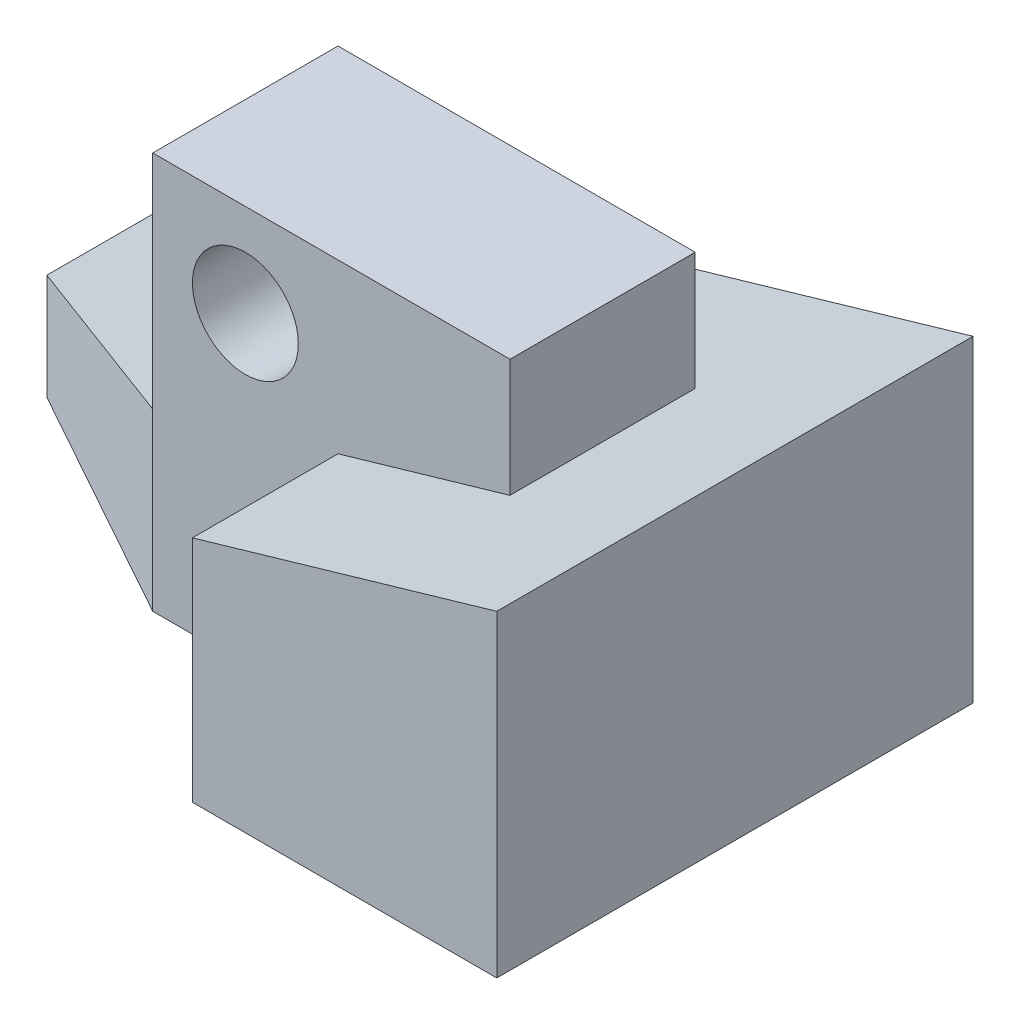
from build123d import *

# Parameters (mm, degrees)
EXTRUDE_1_DEPTH     = 24
CUT_EXTRUDE_1_DEPTH = 70.978568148
EXTRUDE_2_REACH     = 74.256
SKETCH_3_W          = 27
SKETCH_3_H          = 14
SKETCH_4_R          = 4
CUT_EXTRUDE_2_DEPTH = 68.453687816


with BuildPart() as part:
    # Sketch 1 → Extrude 1 (new body)
    with BuildSketch(Plane(origin=(0, 0, 0), x_dir=(1, 0, 0), z_dir=(0, 1, 0))):
        Polygon((0, 0), (55, 0), (55, -36), (32, -36), (32, -25), (18, -25), (0, -15), align=None)
    extrude(amount=EXTRUDE_1_DEPTH)

    # Sketch 2 → Cut-Extrude 1 (cut, through all)
    with BuildSketch(Plane.XY.offset(36)):
        Polygon((55, 24), (0, 8), (0, 24), align=None)
    extrude(amount=-CUT_EXTRUDE_1_DEPTH, mode=Mode.SUBTRACT)

    # Extrude 2: up to this plane
    extrude_2_end = Plane(origin=(55, 24, 0), z_dir=(0.279329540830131, -0.9601952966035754, 0))
    # Sketch 3 → Extrude 2 (add, up to the surface)
    with BuildSketch(Plane.XZ.offset(-30), mode=Mode.PRIVATE) as extrude_2_sk1:
        with Locations((31.5, 18)):
            Rectangle(SKETCH_3_W, SKETCH_3_H)
    extrude_2_tool1 = split(extrude(extrude_2_sk1.sketch, amount=EXTRUDE_2_REACH, mode=Mode.PRIVATE), bisect_by=extrude_2_end, keep=Keep.BOTH, mode=Mode.PRIVATE)
    add(extrude_2_tool1.solids().sort_by_distance((31.5, 30, 18))[0])

    # Sketch 4 → Cut-Extrude 2 (cut, through all)
    with BuildSketch(Plane.XY.offset(25)):
        with Locations((25, 23)):
            Circle(SKETCH_4_R)
    extrude(amount=-CUT_EXTRUDE_2_DEPTH, mode=Mode.SUBTRACT)


solid = part.part
